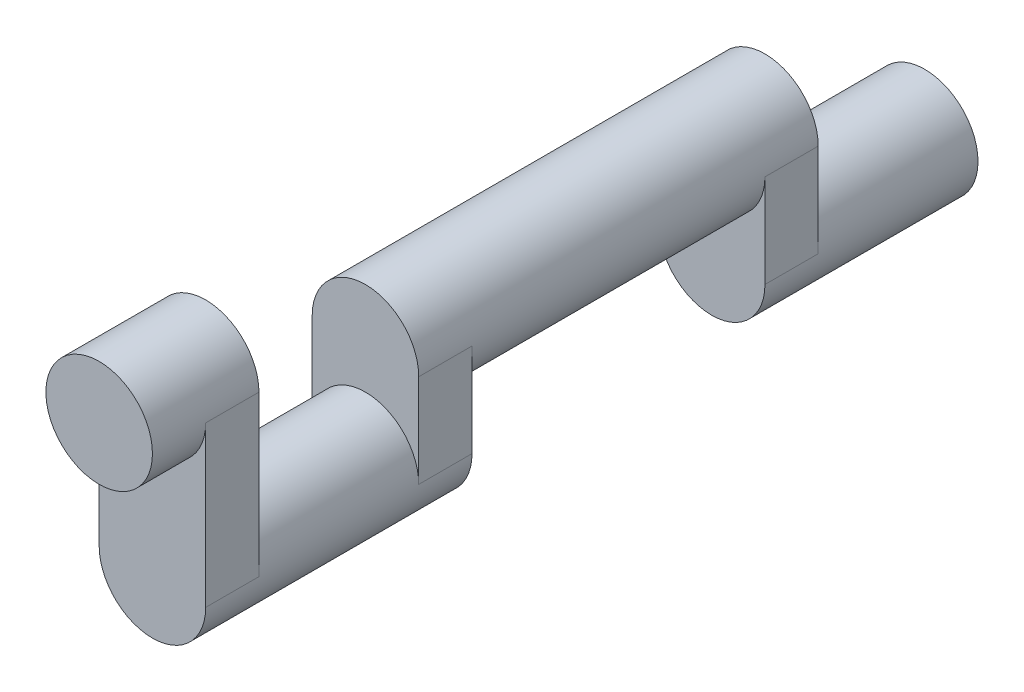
ISO-10303-21;
HEADER;
FILE_DESCRIPTION(('STEP AP214'),'2;1');
FILE_NAME('part.step','',(''),(''),'','','');
FILE_SCHEMA(('AUTOMOTIVE_DESIGN { 1 0 10303 214 1 1 1 1 }'));
ENDSEC;
DATA;
#1=APPLICATION_CONTEXT('core data for automotive mechanical design processes');
#2=APPLICATION_PROTOCOL_DEFINITION('international standard','automotive_design',2000,#1);
#3=PRODUCT_CONTEXT('',#1,'mechanical');
#4=PRODUCT('Part','Part','',(#3));
#5=PRODUCT_RELATED_PRODUCT_CATEGORY('part','',(#4));
#6=PRODUCT_DEFINITION_FORMATION('','',#4);
#7=PRODUCT_DEFINITION_CONTEXT('part definition',#1,'design');
#8=PRODUCT_DEFINITION('design','',#6,#7);
#9=PRODUCT_DEFINITION_SHAPE('','',#8);
#10=(LENGTH_UNIT() NAMED_UNIT(*) SI_UNIT(.MILLI.,.METRE.));
#11=(NAMED_UNIT(*) PLANE_ANGLE_UNIT() SI_UNIT($,.RADIAN.));
#12=(NAMED_UNIT(*) SI_UNIT($,.STERADIAN.) SOLID_ANGLE_UNIT());
#13=UNCERTAINTY_MEASURE_WITH_UNIT(LENGTH_MEASURE(1.E-05),#10,'distance_accuracy_value','');
#14=(GEOMETRIC_REPRESENTATION_CONTEXT(3) GLOBAL_UNCERTAINTY_ASSIGNED_CONTEXT((#13)) GLOBAL_UNIT_ASSIGNED_CONTEXT((#10,
#11,#12)) REPRESENTATION_CONTEXT('',''));
#15=CARTESIAN_POINT('',(0.,0.,0.));
#16=DIRECTION('',(0.,0.,1.));
#17=DIRECTION('',(1.,0.,0.));
#18=AXIS2_PLACEMENT_3D('',#15,#16,#17);
#19=CARTESIAN_POINT('',(0.,-31.75,-317.5));
#20=DIRECTION('',(0.,0.,-1.));
#21=DIRECTION('',(-1.,0.,0.));
#22=AXIS2_PLACEMENT_3D('',#19,#20,#21);
#23=PLANE('',#22);
#24=DIRECTION('',(0.,-1.,0.));
#25=VECTOR('',#24,1.);
#26=CARTESIAN_POINT('',(25.4,-76.2,-317.5));
#27=LINE('',#26,#25);
#28=CARTESIAN_POINT('',(25.4,-31.75,-317.5));
#29=VERTEX_POINT('',#28);
#30=CARTESIAN_POINT('',(25.4,-76.2,-317.5));
#31=VERTEX_POINT('',#30);
#32=EDGE_CURVE('E130',#29,#31,#27,.T.);
#33=ORIENTED_EDGE('',*,*,#32,.T.);
#34=CARTESIAN_POINT('',(0.,-76.2,-317.5));
#35=DIRECTION('',(0.,0.,1.));
#36=DIRECTION('',(1.,0.,0.));
#37=AXIS2_PLACEMENT_3D('',#34,#35,#36);
#38=CIRCLE('',#37,25.4);
#39=CARTESIAN_POINT('',(-25.4,-76.2,-317.5));
#40=VERTEX_POINT('',#39);
#41=EDGE_CURVE('E136',#31,#40,#38,.T.);
#42=ORIENTED_EDGE('',*,*,#41,.T.);
#43=DIRECTION('',(0.,1.,0.));
#44=VECTOR('',#43,1.);
#45=CARTESIAN_POINT('',(-25.4,-31.75,-317.5));
#46=LINE('',#45,#44);
#47=CARTESIAN_POINT('',(-25.4,-31.75,-317.5));
#48=VERTEX_POINT('',#47);
#49=EDGE_CURVE('E48',#40,#48,#46,.T.);
#50=ORIENTED_EDGE('',*,*,#49,.T.);
#51=CARTESIAN_POINT('',(0.,-31.75,-317.5));
#52=DIRECTION('',(0.,0.,-1.));
#53=DIRECTION('',(-1.,0.,0.));
#54=AXIS2_PLACEMENT_3D('',#51,#52,#53);
#55=CIRCLE('',#54,25.4);
#56=EDGE_CURVE('E170',#48,#29,#55,.T.);
#57=ORIENTED_EDGE('',*,*,#56,.T.);
#58=EDGE_LOOP('',(#33,#42,#50,#57));
#59=FACE_BOUND('',#58,.T.);
#60=ADVANCED_FACE('F31',(#59),#23,.T.);
#61=CARTESIAN_POINT('',(0.,-76.2,-152.4));
#62=DIRECTION('',(0.,0.,-1.));
#63=DIRECTION('',(-1.,0.,0.));
#64=AXIS2_PLACEMENT_3D('',#61,#62,#63);
#65=PLANE('',#64);
#66=DIRECTION('',(0.,1.,0.));
#67=VECTOR('',#66,1.);
#68=CARTESIAN_POINT('',(-25.4,-31.75,-152.4));
#69=LINE('',#68,#67);
#70=CARTESIAN_POINT('',(-25.4,-76.2,-152.4));
#71=VERTEX_POINT('',#70);
#72=CARTESIAN_POINT('',(-25.4,-31.75,-152.4));
#73=VERTEX_POINT('',#72);
#74=EDGE_CURVE('E176',#71,#73,#69,.T.);
#75=ORIENTED_EDGE('',*,*,#74,.T.);
#76=CARTESIAN_POINT('',(0.,-31.75,-152.4));
#77=DIRECTION('',(0.,0.,-1.));
#78=DIRECTION('',(-1.,0.,0.));
#79=AXIS2_PLACEMENT_3D('',#76,#77,#78);
#80=CIRCLE('',#79,25.4);
#81=CARTESIAN_POINT('',(25.4,-31.75,-152.4));
#82=VERTEX_POINT('',#81);
#83=EDGE_CURVE('E40',#73,#82,#80,.F.);
#84=ORIENTED_EDGE('',*,*,#83,.T.);
#85=DIRECTION('',(0.,-1.,0.));
#86=VECTOR('',#85,1.);
#87=CARTESIAN_POINT('',(25.4,-76.2,-152.4));
#88=LINE('',#87,#86);
#89=CARTESIAN_POINT('',(25.4,-76.2,-152.4));
#90=VERTEX_POINT('',#89);
#91=EDGE_CURVE('E179',#82,#90,#88,.T.);
#92=ORIENTED_EDGE('',*,*,#91,.T.);
#93=CARTESIAN_POINT('',(0.,-76.2,-152.4));
#94=DIRECTION('',(0.,0.,-1.));
#95=DIRECTION('',(-1.,0.,0.));
#96=AXIS2_PLACEMENT_3D('',#93,#94,#95);
#97=CIRCLE('',#96,25.4);
#98=EDGE_CURVE('E173',#90,#71,#97,.T.);
#99=ORIENTED_EDGE('',*,*,#98,.T.);
#100=EDGE_LOOP('',(#75,#84,#92,#99));
#101=FACE_BOUND('',#100,.T.);
#102=ADVANCED_FACE('F297',(#101),#65,.T.);
#103=CARTESIAN_POINT('',(0.,0.,-25.4));
#104=DIRECTION('',(0.,0.,1.));
#105=DIRECTION('',(1.,0.,0.));
#106=AXIS2_PLACEMENT_3D('',#103,#104,#105);
#107=CYLINDRICAL_SURFACE('',#106,25.4);
#108=CARTESIAN_POINT('',(0.,0.,-25.4));
#109=DIRECTION('',(0.,0.,1.));
#110=DIRECTION('',(1.,0.,0.));
#111=AXIS2_PLACEMENT_3D('',#108,#109,#110);
#112=CIRCLE('',#111,25.4);
#113=CARTESIAN_POINT('',(-25.4,0.,-25.4));
#114=VERTEX_POINT('',#113);
#115=CARTESIAN_POINT('',(25.4,0.,-25.4));
#116=VERTEX_POINT('',#115);
#117=EDGE_CURVE('E240',#114,#116,#112,.T.);
#118=ORIENTED_EDGE('',*,*,#117,.T.);
#119=DIRECTION('',(0.,0.,1.));
#120=VECTOR('',#119,1.);
#121=CARTESIAN_POINT('',(25.4,0.,-50.8));
#122=LINE('',#121,#120);
#123=CARTESIAN_POINT('',(25.4,0.,-50.8));
#124=VERTEX_POINT('',#123);
#125=EDGE_CURVE('E219',#124,#116,#122,.T.);
#126=ORIENTED_EDGE('',*,*,#125,.F.);
#127=CARTESIAN_POINT('',(0.,0.,-50.8));
#128=DIRECTION('',(0.,0.,-1.));
#129=DIRECTION('',(-1.,0.,0.));
#130=AXIS2_PLACEMENT_3D('',#127,#128,#129);
#131=CIRCLE('',#130,25.4);
#132=CARTESIAN_POINT('',(-25.4,0.,-50.8));
#133=VERTEX_POINT('',#132);
#134=EDGE_CURVE('E195',#133,#124,#131,.T.);
#135=ORIENTED_EDGE('',*,*,#134,.F.);
#136=DIRECTION('',(0.,0.,1.));
#137=VECTOR('',#136,1.);
#138=CARTESIAN_POINT('',(-25.4,0.,-50.8));
#139=LINE('',#138,#137);
#140=EDGE_CURVE('E204',#133,#114,#139,.T.);
#141=ORIENTED_EDGE('',*,*,#140,.T.);
#142=EDGE_LOOP('',(#118,#126,#135,#141));
#143=FACE_BOUND('',#142,.T.);
#144=CARTESIAN_POINT('',(0.,0.,0.));
#145=DIRECTION('',(0.,0.,1.));
#146=DIRECTION('',(1.,0.,0.));
#147=AXIS2_PLACEMENT_3D('',#144,#145,#146);
#148=CIRCLE('',#147,25.4);
#149=CARTESIAN_POINT('',(25.4,0.,0.));
#150=VERTEX_POINT('',#149);
#151=EDGE_CURVE('E244',#150,#150,#148,.T.);
#152=ORIENTED_EDGE('',*,*,#151,.F.);
#153=EDGE_LOOP('',(#152));
#154=FACE_BOUND('',#153,.T.);
#155=ADVANCED_FACE('F33',(#143,#154),#107,.T.);
#156=CARTESIAN_POINT('',(0.,0.,0.));
#157=DIRECTION('',(0.,0.,1.));
#158=DIRECTION('',(1.,0.,0.));
#159=AXIS2_PLACEMENT_3D('',#156,#157,#158);
#160=PLANE('',#159);
#161=ORIENTED_EDGE('',*,*,#151,.T.);
#162=EDGE_LOOP('',(#161));
#163=FACE_BOUND('',#162,.T.);
#164=ADVANCED_FACE('F333',(#163),#160,.T.);
#165=CARTESIAN_POINT('',(25.4,0.,-50.8));
#166=DIRECTION('',(-1.,0.,0.));
#167=DIRECTION('',(0.,-1.,0.));
#168=AXIS2_PLACEMENT_3D('',#165,#166,#167);
#169=PLANE('',#168);
#170=DIRECTION('',(0.,-1.,0.));
#171=VECTOR('',#170,1.);
#172=CARTESIAN_POINT('',(25.4,0.,-25.4));
#173=LINE('',#172,#171);
#174=CARTESIAN_POINT('',(25.4,-76.2,-25.4));
#175=VERTEX_POINT('',#174);
#176=EDGE_CURVE('E223',#116,#175,#173,.T.);
#177=ORIENTED_EDGE('',*,*,#176,.T.);
#178=DIRECTION('',(0.,0.,1.));
#179=VECTOR('',#178,1.);
#180=CARTESIAN_POINT('',(25.4,-76.2,-50.8));
#181=LINE('',#180,#179);
#182=CARTESIAN_POINT('',(25.4,-76.2,-50.8));
#183=VERTEX_POINT('',#182);
#184=EDGE_CURVE('E211',#183,#175,#181,.T.);
#185=ORIENTED_EDGE('',*,*,#184,.F.);
#186=DIRECTION('',(0.,-1.,0.));
#187=VECTOR('',#186,1.);
#188=CARTESIAN_POINT('',(25.4,0.,-50.8));
#189=LINE('',#188,#187);
#190=EDGE_CURVE('E205',#124,#183,#189,.T.);
#191=ORIENTED_EDGE('',*,*,#190,.F.);
#192=ORIENTED_EDGE('',*,*,#125,.T.);
#193=EDGE_LOOP('',(#177,#185,#191,#192));
#194=FACE_BOUND('',#193,.T.);
#195=ADVANCED_FACE('F279',(#194),#169,.F.);
#196=CARTESIAN_POINT('',(0.,-76.2,-50.8));
#197=DIRECTION('',(0.,0.,1.));
#198=DIRECTION('',(1.,0.,0.));
#199=AXIS2_PLACEMENT_3D('',#196,#197,#198);
#200=CYLINDRICAL_SURFACE('',#199,25.4);
#201=CARTESIAN_POINT('',(0.,-76.2,-25.4));
#202=DIRECTION('',(0.,0.,-1.));
#203=DIRECTION('',(-1.,0.,0.));
#204=AXIS2_PLACEMENT_3D('',#201,#202,#203);
#205=CIRCLE('',#204,25.4);
#206=CARTESIAN_POINT('',(-25.4,-76.2,-25.4));
#207=VERTEX_POINT('',#206);
#208=EDGE_CURVE('E258',#175,#207,#205,.T.);
#209=ORIENTED_EDGE('',*,*,#208,.T.);
#210=DIRECTION('',(0.,0.,1.));
#211=VECTOR('',#210,1.);
#212=CARTESIAN_POINT('',(-25.4,-76.2,-50.8));
#213=LINE('',#212,#211);
#214=CARTESIAN_POINT('',(-25.4,-76.2,-50.8));
#215=VERTEX_POINT('',#214);
#216=EDGE_CURVE('E208',#215,#207,#213,.T.);
#217=ORIENTED_EDGE('',*,*,#216,.F.);
#218=CARTESIAN_POINT('',(0.,-76.2,-50.8));
#219=DIRECTION('',(0.,0.,-1.));
#220=DIRECTION('',(-1.,0.,0.));
#221=AXIS2_PLACEMENT_3D('',#218,#219,#220);
#222=CIRCLE('',#221,25.4);
#223=EDGE_CURVE('E191',#215,#183,#222,.T.);
#224=ORIENTED_EDGE('',*,*,#223,.T.);
#225=ORIENTED_EDGE('',*,*,#184,.T.);
#226=EDGE_LOOP('',(#209,#217,#224,#225));
#227=FACE_BOUND('',#226,.T.);
#228=CARTESIAN_POINT('',(0.,-76.2,-127.));
#229=DIRECTION('',(0.,0.,-1.));
#230=DIRECTION('',(-1.,0.,0.));
#231=AXIS2_PLACEMENT_3D('',#228,#229,#230);
#232=CIRCLE('',#231,25.4);
#233=CARTESIAN_POINT('',(-25.4,-76.2,-127.));
#234=VERTEX_POINT('',#233);
#235=CARTESIAN_POINT('',(25.4,-76.2,-127.));
#236=VERTEX_POINT('',#235);
#237=EDGE_CURVE('E56',#234,#236,#232,.T.);
#238=ORIENTED_EDGE('',*,*,#237,.F.);
#239=DIRECTION('',(0.,0.,1.));
#240=VECTOR('',#239,1.);
#241=CARTESIAN_POINT('',(-25.4,-76.2,-152.4));
#242=LINE('',#241,#240);
#243=EDGE_CURVE('E190',#71,#234,#242,.T.);
#244=ORIENTED_EDGE('',*,*,#243,.F.);
#245=ORIENTED_EDGE('',*,*,#98,.F.);
#246=DIRECTION('',(0.,0.,1.));
#247=VECTOR('',#246,1.);
#248=CARTESIAN_POINT('',(25.4,-76.2,-152.4));
#249=LINE('',#248,#247);
#250=EDGE_CURVE('E181',#90,#236,#249,.T.);
#251=ORIENTED_EDGE('',*,*,#250,.T.);
#252=EDGE_LOOP('',(#238,#244,#245,#251));
#253=FACE_BOUND('',#252,.T.);
#254=ADVANCED_FACE('F281',(#227,#253),#200,.T.);
#255=CARTESIAN_POINT('',(-25.4,-76.2,-50.8));
#256=DIRECTION('',(1.,0.,0.));
#257=DIRECTION('',(0.,1.,0.));
#258=AXIS2_PLACEMENT_3D('',#255,#256,#257);
#259=PLANE('',#258);
#260=DIRECTION('',(0.,1.,0.));
#261=VECTOR('',#260,1.);
#262=CARTESIAN_POINT('',(-25.4,-76.2,-25.4));
#263=LINE('',#262,#261);
#264=EDGE_CURVE('E261',#207,#114,#263,.T.);
#265=ORIENTED_EDGE('',*,*,#264,.T.);
#266=ORIENTED_EDGE('',*,*,#140,.F.);
#267=DIRECTION('',(0.,1.,0.));
#268=VECTOR('',#267,1.);
#269=CARTESIAN_POINT('',(-25.4,-76.2,-50.8));
#270=LINE('',#269,#268);
#271=EDGE_CURVE('E202',#215,#133,#270,.T.);
#272=ORIENTED_EDGE('',*,*,#271,.F.);
#273=ORIENTED_EDGE('',*,*,#216,.T.);
#274=EDGE_LOOP('',(#265,#266,#272,#273));
#275=FACE_BOUND('',#274,.T.);
#276=ADVANCED_FACE('F270',(#275),#259,.F.);
#277=CARTESIAN_POINT('',(0.,0.,-50.8));
#278=DIRECTION('',(0.,0.,-1.));
#279=DIRECTION('',(-1.,0.,0.));
#280=AXIS2_PLACEMENT_3D('',#277,#278,#279);
#281=PLANE('',#280);
#282=ORIENTED_EDGE('',*,*,#223,.F.);
#283=ORIENTED_EDGE('',*,*,#271,.T.);
#284=ORIENTED_EDGE('',*,*,#134,.T.);
#285=ORIENTED_EDGE('',*,*,#190,.T.);
#286=EDGE_LOOP('',(#282,#283,#284,#285));
#287=FACE_BOUND('',#286,.T.);
#288=ADVANCED_FACE('F285',(#287),#281,.T.);
#289=CARTESIAN_POINT('',(0.,0.,-25.4));
#290=DIRECTION('',(0.,0.,-1.));
#291=DIRECTION('',(-1.,0.,0.));
#292=AXIS2_PLACEMENT_3D('',#289,#290,#291);
#293=PLANE('',#292);
#294=ORIENTED_EDGE('',*,*,#117,.F.);
#295=ORIENTED_EDGE('',*,*,#264,.F.);
#296=ORIENTED_EDGE('',*,*,#208,.F.);
#297=ORIENTED_EDGE('',*,*,#176,.F.);
#298=EDGE_LOOP('',(#294,#295,#296,#297));
#299=FACE_BOUND('',#298,.T.);
#300=ADVANCED_FACE('F275',(#299),#293,.F.);
#301=CARTESIAN_POINT('',(0.,-76.2,-127.));
#302=DIRECTION('',(0.,0.,-1.));
#303=DIRECTION('',(-1.,0.,0.));
#304=AXIS2_PLACEMENT_3D('',#301,#302,#303);
#305=PLANE('',#304);
#306=CARTESIAN_POINT('',(0.,-31.75,-127.));
#307=DIRECTION('',(0.,0.,-1.));
#308=DIRECTION('',(1.,0.,0.));
#309=AXIS2_PLACEMENT_3D('',#306,#307,#308);
#310=CIRCLE('',#309,25.4);
#311=CARTESIAN_POINT('',(-25.4,-31.75,-127.));
#312=VERTEX_POINT('',#311);
#313=CARTESIAN_POINT('',(25.4,-31.75,-127.));
#314=VERTEX_POINT('',#313);
#315=EDGE_CURVE('E182',#312,#314,#310,.T.);
#316=ORIENTED_EDGE('',*,*,#315,.F.);
#317=DIRECTION('',(0.,1.,0.));
#318=VECTOR('',#317,1.);
#319=CARTESIAN_POINT('',(-25.4,-31.75,-127.));
#320=LINE('',#319,#318);
#321=EDGE_CURVE('E172',#234,#312,#320,.T.);
#322=ORIENTED_EDGE('',*,*,#321,.F.);
#323=ORIENTED_EDGE('',*,*,#237,.T.);
#324=DIRECTION('',(0.,-1.,0.));
#325=VECTOR('',#324,1.);
#326=CARTESIAN_POINT('',(25.4,-76.2,-127.));
#327=LINE('',#326,#325);
#328=EDGE_CURVE('E177',#314,#236,#327,.T.);
#329=ORIENTED_EDGE('',*,*,#328,.F.);
#330=EDGE_LOOP('',(#316,#322,#323,#329));
#331=FACE_BOUND('',#330,.T.);
#332=ADVANCED_FACE('F292',(#331),#305,.F.);
#333=CARTESIAN_POINT('',(-25.4,-31.75,-152.4));
#334=DIRECTION('',(1.,0.,0.));
#335=DIRECTION('',(0.,1.,0.));
#336=AXIS2_PLACEMENT_3D('',#333,#334,#335);
#337=PLANE('',#336);
#338=ORIENTED_EDGE('',*,*,#321,.T.);
#339=DIRECTION('',(0.,0.,1.));
#340=VECTOR('',#339,1.);
#341=CARTESIAN_POINT('',(-25.4,-31.75,-152.4));
#342=LINE('',#341,#340);
#343=EDGE_CURVE('E187',#73,#312,#342,.T.);
#344=ORIENTED_EDGE('',*,*,#343,.F.);
#345=ORIENTED_EDGE('',*,*,#74,.F.);
#346=ORIENTED_EDGE('',*,*,#243,.T.);
#347=EDGE_LOOP('',(#338,#344,#345,#346));
#348=FACE_BOUND('',#347,.T.);
#349=ADVANCED_FACE('F309',(#348),#337,.F.);
#350=CARTESIAN_POINT('',(0.,-31.75,-152.4));
#351=DIRECTION('',(0.,0.,1.));
#352=DIRECTION('',(1.,0.,0.));
#353=AXIS2_PLACEMENT_3D('',#350,#351,#352);
#354=CYLINDRICAL_SURFACE('',#353,25.4);
#355=ORIENTED_EDGE('',*,*,#56,.F.);
#356=DIRECTION('',(0.,0.,-1.));
#357=VECTOR('',#356,1.);
#358=CARTESIAN_POINT('',(-25.4,-31.75,-292.1));
#359=LINE('',#358,#357);
#360=CARTESIAN_POINT('',(-25.4,-31.75,-292.1));
#361=VERTEX_POINT('',#360);
#362=EDGE_CURVE('E127',#361,#48,#359,.T.);
#363=ORIENTED_EDGE('',*,*,#362,.F.);
#364=CARTESIAN_POINT('',(0.,-31.75,-292.1));
#365=DIRECTION('',(0.,0.,-1.));
#366=DIRECTION('',(-1.,0.,0.));
#367=AXIS2_PLACEMENT_3D('',#364,#365,#366);
#368=CIRCLE('',#367,25.4);
#369=CARTESIAN_POINT('',(25.4,-31.75,-292.1));
#370=VERTEX_POINT('',#369);
#371=EDGE_CURVE('E11',#370,#361,#368,.T.);
#372=ORIENTED_EDGE('',*,*,#371,.F.);
#373=DIRECTION('',(0.,0.,-1.));
#374=VECTOR('',#373,1.);
#375=CARTESIAN_POINT('',(25.4,-31.75,-292.1));
#376=LINE('',#375,#374);
#377=EDGE_CURVE('E158',#370,#29,#376,.T.);
#378=ORIENTED_EDGE('',*,*,#377,.T.);
#379=EDGE_LOOP('',(#355,#363,#372,#378));
#380=FACE_BOUND('',#379,.T.);
#381=ORIENTED_EDGE('',*,*,#315,.T.);
#382=DIRECTION('',(0.,0.,1.));
#383=VECTOR('',#382,1.);
#384=CARTESIAN_POINT('',(25.4,-31.75,-152.4));
#385=LINE('',#384,#383);
#386=EDGE_CURVE('E184',#82,#314,#385,.T.);
#387=ORIENTED_EDGE('',*,*,#386,.F.);
#388=ORIENTED_EDGE('',*,*,#83,.F.);
#389=ORIENTED_EDGE('',*,*,#343,.T.);
#390=EDGE_LOOP('',(#381,#387,#388,#389));
#391=FACE_BOUND('',#390,.T.);
#392=ADVANCED_FACE('F314',(#380,#391),#354,.T.);
#393=CARTESIAN_POINT('',(25.4,-76.2,-152.4));
#394=DIRECTION('',(-1.,0.,0.));
#395=DIRECTION('',(0.,0.,1.));
#396=AXIS2_PLACEMENT_3D('',#393,#394,#395);
#397=PLANE('',#396);
#398=ORIENTED_EDGE('',*,*,#328,.T.);
#399=ORIENTED_EDGE('',*,*,#250,.F.);
#400=ORIENTED_EDGE('',*,*,#91,.F.);
#401=ORIENTED_EDGE('',*,*,#386,.T.);
#402=EDGE_LOOP('',(#398,#399,#400,#401));
#403=FACE_BOUND('',#402,.T.);
#404=ADVANCED_FACE('F310',(#403),#397,.F.);
#405=CARTESIAN_POINT('',(0.,-31.75,-292.1));
#406=DIRECTION('',(0.,0.,-1.));
#407=DIRECTION('',(-1.,0.,0.));
#408=AXIS2_PLACEMENT_3D('',#405,#406,#407);
#409=PLANE('',#408);
#410=DIRECTION('',(0.,-1.,0.));
#411=VECTOR('',#410,1.);
#412=CARTESIAN_POINT('',(25.4,-76.2,-292.1));
#413=LINE('',#412,#411);
#414=CARTESIAN_POINT('',(25.4,-76.2,-292.1));
#415=VERTEX_POINT('',#414);
#416=EDGE_CURVE('E129',#370,#415,#413,.T.);
#417=ORIENTED_EDGE('',*,*,#416,.F.);
#418=ORIENTED_EDGE('',*,*,#371,.T.);
#419=DIRECTION('',(0.,1.,0.));
#420=VECTOR('',#419,1.);
#421=CARTESIAN_POINT('',(-25.4,-31.75,-292.1));
#422=LINE('',#421,#420);
#423=CARTESIAN_POINT('',(-25.4,-76.2,-292.1));
#424=VERTEX_POINT('',#423);
#425=EDGE_CURVE('E163',#424,#361,#422,.T.);
#426=ORIENTED_EDGE('',*,*,#425,.F.);
#427=CARTESIAN_POINT('',(0.,-76.2,-292.1));
#428=DIRECTION('',(0.,0.,-1.));
#429=DIRECTION('',(1.,0.,0.));
#430=AXIS2_PLACEMENT_3D('',#427,#428,#429);
#431=CIRCLE('',#430,25.4);
#432=EDGE_CURVE('E138',#415,#424,#431,.T.);
#433=ORIENTED_EDGE('',*,*,#432,.F.);
#434=EDGE_LOOP('',(#417,#418,#426,#433));
#435=FACE_BOUND('',#434,.T.);
#436=ADVANCED_FACE('F313',(#435),#409,.F.);
#437=CARTESIAN_POINT('',(-25.4,-31.75,-292.1));
#438=DIRECTION('',(-1.,0.,0.));
#439=DIRECTION('',(0.,-1.,0.));
#440=AXIS2_PLACEMENT_3D('',#437,#438,#439);
#441=PLANE('',#440);
#442=ORIENTED_EDGE('',*,*,#49,.F.);
#443=DIRECTION('',(0.,0.,-1.));
#444=VECTOR('',#443,1.);
#445=CARTESIAN_POINT('',(-25.4,-76.2,-292.1));
#446=LINE('',#445,#444);
#447=EDGE_CURVE('E124',#424,#40,#446,.T.);
#448=ORIENTED_EDGE('',*,*,#447,.F.);
#449=ORIENTED_EDGE('',*,*,#425,.T.);
#450=ORIENTED_EDGE('',*,*,#362,.T.);
#451=EDGE_LOOP('',(#442,#448,#449,#450));
#452=FACE_BOUND('',#451,.T.);
#453=ADVANCED_FACE('F122',(#452),#441,.T.);
#454=CARTESIAN_POINT('',(0.,-76.2,-292.1));
#455=DIRECTION('',(0.,0.,-1.));
#456=DIRECTION('',(-1.,0.,0.));
#457=AXIS2_PLACEMENT_3D('',#454,#455,#456);
#458=CYLINDRICAL_SURFACE('',#457,25.4);
#459=ORIENTED_EDGE('',*,*,#447,.T.);
#460=ORIENTED_EDGE('',*,*,#41,.F.);
#461=DIRECTION('',(0.,0.,-1.));
#462=VECTOR('',#461,1.);
#463=CARTESIAN_POINT('',(25.4,-76.2,-292.1));
#464=LINE('',#463,#462);
#465=EDGE_CURVE('E140',#415,#31,#464,.T.);
#466=ORIENTED_EDGE('',*,*,#465,.F.);
#467=ORIENTED_EDGE('',*,*,#432,.T.);
#468=EDGE_LOOP('',(#459,#460,#466,#467));
#469=FACE_BOUND('',#468,.T.);
#470=CARTESIAN_POINT('',(0.,-76.2,-393.7));
#471=DIRECTION('',(0.,0.,1.));
#472=DIRECTION('',(1.,0.,0.));
#473=AXIS2_PLACEMENT_3D('',#470,#471,#472);
#474=CIRCLE('',#473,25.4);
#475=CARTESIAN_POINT('',(25.4,-76.2,-393.7));
#476=VERTEX_POINT('',#475);
#477=EDGE_CURVE('E143',#476,#476,#474,.T.);
#478=ORIENTED_EDGE('',*,*,#477,.T.);
#479=EDGE_LOOP('',(#478));
#480=FACE_BOUND('',#479,.T.);
#481=ADVANCED_FACE('F134',(#469,#480),#458,.T.);
#482=CARTESIAN_POINT('',(25.4,-76.2,-292.1));
#483=DIRECTION('',(1.,0.,0.));
#484=DIRECTION('',(0.,1.,0.));
#485=AXIS2_PLACEMENT_3D('',#482,#483,#484);
#486=PLANE('',#485);
#487=ORIENTED_EDGE('',*,*,#32,.F.);
#488=ORIENTED_EDGE('',*,*,#377,.F.);
#489=ORIENTED_EDGE('',*,*,#416,.T.);
#490=ORIENTED_EDGE('',*,*,#465,.T.);
#491=EDGE_LOOP('',(#487,#488,#489,#490));
#492=FACE_BOUND('',#491,.T.);
#493=ADVANCED_FACE('F304',(#492),#486,.T.);
#494=CARTESIAN_POINT('',(0.,-76.2,-393.7));
#495=DIRECTION('',(0.,0.,1.));
#496=DIRECTION('',(1.,0.,0.));
#497=AXIS2_PLACEMENT_3D('',#494,#495,#496);
#498=PLANE('',#497);
#499=ORIENTED_EDGE('',*,*,#477,.F.);
#500=EDGE_LOOP('',(#499));
#501=FACE_BOUND('',#500,.T.);
#502=ADVANCED_FACE('F413',(#501),#498,.F.);
#503=CLOSED_SHELL('',(#60,#102,#155,#164,#195,#254,#276,#288,#300,#332,#349,#392,#404,#436,#453,
#481,#493,#502));
#504=MANIFOLD_SOLID_BREP('B2',#503);
#505=ADVANCED_BREP_SHAPE_REPRESENTATION('',(#18,#504),#14);
#506=SHAPE_DEFINITION_REPRESENTATION(#9,#505);
ENDSEC;
END-ISO-10303-21;
